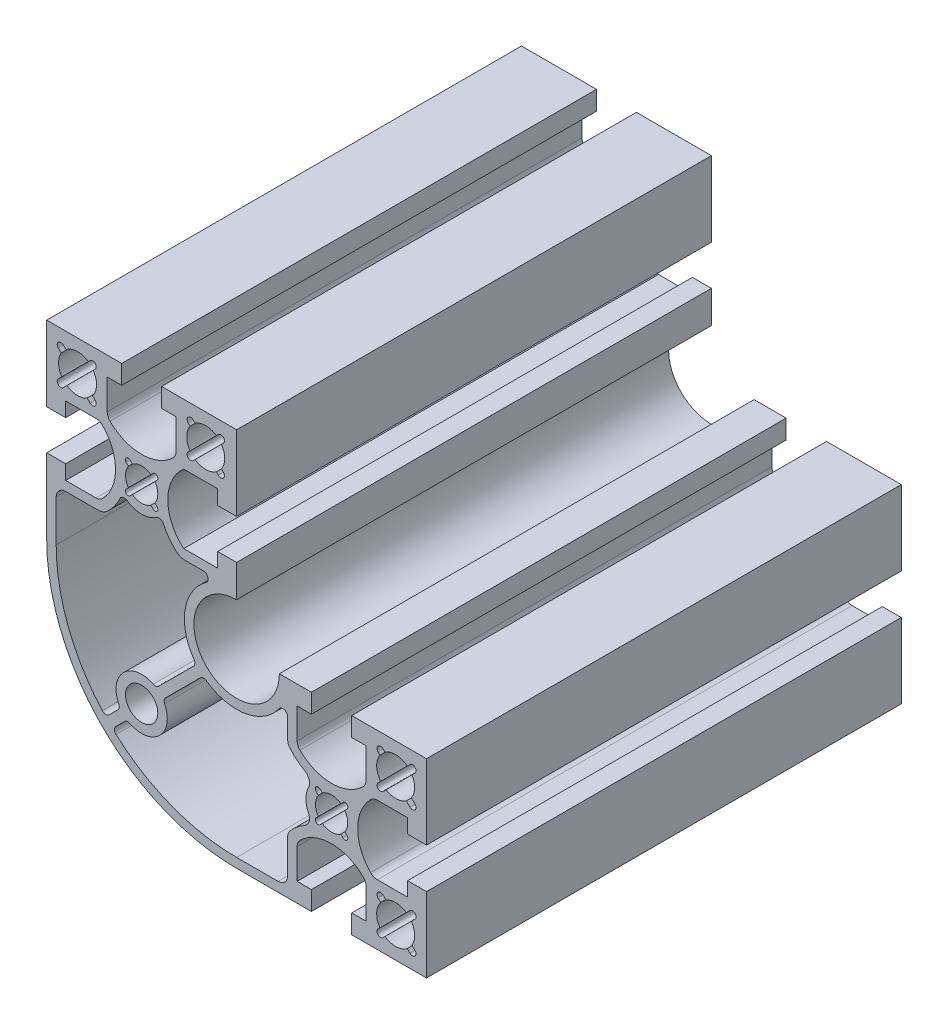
from build123d import *

# Parameters (mm, degrees)
EXTRUDE_1_DEPTH     = 50
SKETCH_2_R          = 4
SKETCH_2_R_2        = 3.4
CUT_EXTRUDE_1_DEPTH = 115.891252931
CUT_EXTRUDE_2_DEPTH = 115.891252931
CUT_EXTRUDE_3_DEPTH = 115.891252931
FILLET_1_R          = 2
CUT_EXTRUDE_5_DEPTH = 115.891252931


with BuildPart() as part:
    # Sketch 1 → Extrude 1 (new, symmetric)
    with BuildSketch(Plane.XY):
        with BuildLine():
            Line((0, 40), (0, 9))
            ThreePointArc((0, 9), (-6.363961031, -6.363961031), (9, 0))
            Line((9, 0), (40, 0))
            Line((40, 0), (40, -40))
            Line((40, -40), (0, -40))
            ThreePointArc((0, -40), (-28.284271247, -28.284271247), (-40, 0))
            Line((-40, 0), (-40, 40))
            Line((-40, 40), (0, 40))
        make_face()
    extrude(amount=EXTRUDE_1_DEPTH, both=True)

    # Sketch 2 → Cut-Extrude 1 (cut, through all)
    with BuildSketch(Plane.XY.offset(50)):
        with Locations((-33.5, 33.5)):
            Circle(SKETCH_2_R)
        with Locations((-6.5, 33.5)):
            Circle(SKETCH_2_R)
        with Locations((-20, 20)):
            Circle(SKETCH_2_R_2)
        with Locations((-20, -20)):
            Circle(SKETCH_2_R_2)
        with Locations((33.5, -33.5)):
            Circle(SKETCH_2_R)
        with Locations(Location((33.5, -6.5, 0), (0, 0, 180))):
            Circle(SKETCH_2_R)
        with Locations((20, -20)):
            Circle(SKETCH_2_R_2)
    extrude(amount=-CUT_EXTRUDE_1_DEPTH, mode=Mode.SUBTRACT)

    # Sketch 3 → Cut-Extrude 2 (cut, through all)
    with BuildSketch(Plane.XY.offset(50)):
        with BuildLine():
            Line((-29.787689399, 36.151650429), (-30.848349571, 35.090990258))
            ThreePointArc((-30.848349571, 35.090990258), (-31.909009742, 35.090990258), (-31.909009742, 36.151650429))
            Line((-31.909009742, 36.151650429), (-30.848349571, 37.212310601))
            ThreePointArc((-30.848349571, 37.212310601), (-29.787689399, 37.212310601), (-29.787689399, 36.151650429))
        make_face()
        with BuildLine():
            Line((-30.848349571, 29.434136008), (-31.909009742, 30.49479618))
            ThreePointArc((-31.909009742, 30.49479618), (-31.909009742, 31.555456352), (-30.848349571, 31.555456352))
            Line((-30.848349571, 31.555456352), (-29.787689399, 30.49479618))
            ThreePointArc((-29.787689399, 30.49479618), (-29.787689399, 29.434136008), (-30.848349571, 29.434136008))
        make_face()
        with BuildLine():
            Line((-37.565863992, 30.49479618), (-36.50520382, 31.555456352))
            ThreePointArc((-36.50520382, 31.555456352), (-35.444543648, 31.555456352), (-35.444543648, 30.49479618))
            Line((-35.444543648, 30.49479618), (-36.50520382, 29.434136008))
            ThreePointArc((-36.50520382, 29.434136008), (-37.565863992, 29.434136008), (-37.565863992, 30.49479618))
        make_face()
        with BuildLine():
            Line((-36.50520382, 37.212310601), (-35.444543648, 36.151650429))
            ThreePointArc((-35.444543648, 36.151650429), (-35.444543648, 35.090990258), (-36.50520382, 35.090990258))
            Line((-36.50520382, 35.090990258), (-37.565863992, 36.151650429))
            ThreePointArc((-37.565863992, 36.151650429), (-37.565863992, 37.212310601), (-36.50520382, 37.212310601))
        make_face()
        with BuildLine():
            Line((-2.787689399, 36.151650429), (-3.848349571, 35.090990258))
            ThreePointArc((-3.848349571, 35.090990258), (-4.909009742, 35.090990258), (-4.909009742, 36.151650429))
            Line((-4.909009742, 36.151650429), (-3.848349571, 37.212310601))
            ThreePointArc((-3.848349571, 37.212310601), (-2.787689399, 37.212310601), (-2.787689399, 36.151650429))
        make_face()
        with BuildLine():
            Line((-3.848349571, 29.787689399), (-4.909009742, 30.848349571))
            ThreePointArc((-4.909009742, 30.848349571), (-4.909009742, 31.909009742), (-3.848349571, 31.909009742))
            Line((-3.848349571, 31.909009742), (-2.787689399, 30.848349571))
            ThreePointArc((-2.787689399, 30.848349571), (-2.787689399, 29.787689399), (-3.848349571, 29.787689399))
        make_face()
        with BuildLine():
            Line((-10.212310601, 30.848349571), (-9.151650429, 31.909009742))
            ThreePointArc((-9.151650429, 31.909009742), (-8.090990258, 31.909009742), (-8.090990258, 30.848349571))
            Line((-8.090990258, 30.848349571), (-9.151650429, 29.787689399))
            ThreePointArc((-9.151650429, 29.787689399), (-10.212310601, 29.787689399), (-10.212310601, 30.848349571))
        make_face()
        with BuildLine():
            Line((-9.151650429, 37.212310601), (-8.090990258, 36.151650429))
            ThreePointArc((-8.090990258, 36.151650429), (-8.090990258, 35.090990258), (-9.151650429, 35.090990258))
            Line((-9.151650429, 35.090990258), (-10.212310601, 36.151650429))
            ThreePointArc((-10.212310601, 36.151650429), (-10.212310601, 37.212310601), (-9.151650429, 37.212310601))
        make_face()
        with BuildLine():
            Line((-16.747308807, 22.404163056), (-17.454415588, 21.697056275))
            ThreePointArc((-17.454415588, 21.697056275), (-18.302943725, 21.697056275), (-18.302943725, 22.545584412))
            Line((-18.302943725, 22.545584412), (-17.595836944, 23.252691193))
            ThreePointArc((-17.595836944, 23.252691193), (-16.747308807, 23.252691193), (-16.747308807, 22.404163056))
        make_face()
        with BuildLine():
            Line((-17.595836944, 16.747308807), (-18.302943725, 17.454415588))
            ThreePointArc((-18.302943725, 17.454415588), (-18.302943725, 18.302943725), (-17.454415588, 18.302943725))
            Line((-17.454415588, 18.302943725), (-16.747308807, 17.595836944))
            ThreePointArc((-16.747308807, 17.595836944), (-16.747308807, 16.747308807), (-17.595836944, 16.747308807))
        make_face()
        with BuildLine():
            Line((-23.252691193, 17.595836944), (-22.545584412, 18.302943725))
            ThreePointArc((-22.545584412, 18.302943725), (-21.697056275, 18.302943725), (-21.697056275, 17.454415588))
            Line((-21.697056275, 17.454415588), (-22.404163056, 16.747308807))
            ThreePointArc((-22.404163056, 16.747308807), (-23.252691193, 16.747308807), (-23.252691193, 17.595836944))
        make_face()
        with BuildLine():
            Line((-22.404163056, 23.252691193), (-21.697056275, 22.545584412))
            ThreePointArc((-21.697056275, 22.545584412), (-21.697056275, 21.697056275), (-22.545584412, 21.697056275))
            Line((-22.545584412, 21.697056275), (-23.252691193, 22.404163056))
            ThreePointArc((-23.252691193, 22.404163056), (-23.252691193, 23.252691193), (-22.404163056, 23.252691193))
        make_face()
        with BuildLine():
            Line((29.787689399, -36.151650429), (30.848349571, -35.090990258))
            ThreePointArc((30.848349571, -35.090990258), (31.909009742, -35.090990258), (31.909009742, -36.151650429))
            Line((31.909009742, -36.151650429), (30.848349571, -37.212310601))
            ThreePointArc((30.848349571, -37.212310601), (29.787689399, -37.212310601), (29.787689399, -36.151650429))
        make_face()
        with BuildLine():
            Line((30.848349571, -29.434136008), (31.909009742, -30.49479618))
            ThreePointArc((31.909009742, -30.49479618), (31.909009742, -31.555456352), (30.848349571, -31.555456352))
            Line((30.848349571, -31.555456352), (29.787689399, -30.49479618))
            ThreePointArc((29.787689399, -30.49479618), (29.787689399, -29.434136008), (30.848349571, -29.434136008))
        make_face()
        with BuildLine():
            Line((37.565863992, -30.49479618), (36.50520382, -31.555456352))
            ThreePointArc((36.50520382, -31.555456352), (35.444543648, -31.555456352), (35.444543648, -30.49479618))
            Line((35.444543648, -30.49479618), (36.50520382, -29.434136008))
            ThreePointArc((36.50520382, -29.434136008), (37.565863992, -29.434136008), (37.565863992, -30.49479618))
        make_face()
        with BuildLine():
            Line((36.50520382, -37.212310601), (35.444543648, -36.151650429))
            ThreePointArc((35.444543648, -36.151650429), (35.444543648, -35.090990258), (36.50520382, -35.090990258))
            Line((36.50520382, -35.090990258), (37.565863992, -36.151650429))
            ThreePointArc((37.565863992, -36.151650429), (37.565863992, -37.212310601), (36.50520382, -37.212310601))
        make_face()
        with BuildLine():
            Line((16.747308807, -22.404163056), (17.454415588, -21.697056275))
            ThreePointArc((17.454415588, -21.697056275), (18.302943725, -21.697056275), (18.302943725, -22.545584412))
            Line((18.302943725, -22.545584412), (17.595836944, -23.252691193))
            ThreePointArc((17.595836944, -23.252691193), (16.747308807, -23.252691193), (16.747308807, -22.404163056))
        make_face()
        with BuildLine():
            Line((17.595836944, -16.747308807), (18.302943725, -17.454415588))
            ThreePointArc((18.302943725, -17.454415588), (18.302943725, -18.302943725), (17.454415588, -18.302943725))
            Line((17.454415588, -18.302943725), (16.747308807, -17.595836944))
            ThreePointArc((16.747308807, -17.595836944), (16.747308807, -16.747308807), (17.595836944, -16.747308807))
        make_face()
        with BuildLine():
            Line((23.252691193, -17.595836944), (22.545584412, -18.302943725))
            ThreePointArc((22.545584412, -18.302943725), (21.697056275, -18.302943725), (21.697056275, -17.454415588))
            Line((21.697056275, -17.454415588), (22.404163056, -16.747308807))
            ThreePointArc((22.404163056, -16.747308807), (23.252691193, -16.747308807), (23.252691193, -17.595836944))
        make_face()
        with BuildLine():
            Line((22.404163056, -23.252691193), (21.697056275, -22.545584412))
            ThreePointArc((21.697056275, -22.545584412), (21.697056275, -21.697056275), (22.545584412, -21.697056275))
            Line((22.545584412, -21.697056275), (23.252691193, -22.404163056))
            ThreePointArc((23.252691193, -22.404163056), (23.252691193, -23.252691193), (22.404163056, -23.252691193))
        make_face()
        with BuildLine():
            Line((36.50520382, -2.787689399), (35.444543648, -3.848349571))
            ThreePointArc((35.444543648, -3.848349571), (35.444543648, -4.909009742), (36.50520382, -4.909009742))
            Line((36.50520382, -4.909009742), (37.565863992, -3.848349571))
            ThreePointArc((37.565863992, -3.848349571), (37.565863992, -2.787689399), (36.50520382, -2.787689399))
        make_face()
        with BuildLine():
            Line((37.565863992, -9.50520382), (36.50520382, -8.444543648))
            ThreePointArc((36.50520382, -8.444543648), (35.444543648, -8.444543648), (35.444543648, -9.50520382))
            Line((35.444543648, -9.50520382), (36.50520382, -10.565863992))
            ThreePointArc((36.50520382, -10.565863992), (37.565863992, -10.565863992), (37.565863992, -9.50520382))
        make_face()
        with BuildLine():
            Line((30.848349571, -10.565863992), (31.909009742, -9.50520382))
            ThreePointArc((31.909009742, -9.50520382), (31.909009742, -8.444543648), (30.848349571, -8.444543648))
            Line((30.848349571, -8.444543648), (29.787689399, -9.50520382))
            ThreePointArc((29.787689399, -9.50520382), (29.787689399, -10.565863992), (30.848349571, -10.565863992))
        make_face()
        with BuildLine():
            Line((29.787689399, -3.848349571), (30.848349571, -4.909009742))
            ThreePointArc((30.848349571, -4.909009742), (31.909009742, -4.909009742), (31.909009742, -3.848349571))
            Line((31.909009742, -3.848349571), (30.848349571, -2.787689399))
            ThreePointArc((30.848349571, -2.787689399), (29.787689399, -2.787689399), (29.787689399, -3.848349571))
        make_face()
    extrude(amount=-CUT_EXTRUDE_2_DEPTH, mode=Mode.SUBTRACT)

    # Sketch 4 → Cut-Extrude 3 (cut, through all)
    with BuildSketch(Plane.XY.offset(50)):
        with BuildLine():
            Line((-24.2, 40), (-24.2, 36))
            Line((-24.2, 36), (-27.25, 36))
            Line((-27.25, 36), (-27.25, 28.860985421))
            ThreePointArc((-27.25, 28.860985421), (-20, 25.5), (-12.75, 28.860985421))
            Line((-12.75, 28.860985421), (-12.75, 36))
            Line((-12.75, 36), (-15.8, 36))
            Line((-15.8, 36), (-15.8, 40))
            Line((-15.8, 40), (-24.2, 40))
        make_face()
        with BuildLine():
            Line((0, 24.2), (0, 15.8))
            Line((0, 15.8), (-4, 15.8))
            Line((-4, 15.8), (-4, 12.75))
            Line((-4, 12.75), (-11.139014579, 12.75))
            ThreePointArc((-11.139014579, 12.75), (-14.5, 20), (-11.139014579, 27.25))
            Line((-11.139014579, 27.25), (-4, 27.25))
            Line((-4, 27.25), (-4, 24.2))
            Line((-4, 24.2), (0, 24.2))
        make_face()
        with BuildLine():
            Line((-40, 15.8), (-40, 24.2))
            Line((-40, 24.2), (-36, 24.2))
            Line((-36, 24.2), (-36, 27.25))
            Line((-36, 27.25), (-28.860985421, 27.25))
            ThreePointArc((-28.860985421, 27.25), (-25.5, 20), (-28.860985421, 12.75))
            Line((-28.860985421, 12.75), (-36, 12.75))
            Line((-36, 12.75), (-36, 15.8))
            Line((-36, 15.8), (-40, 15.8))
        make_face()
        with BuildLine():
            Line((12.75, -4), (12.75, -11.139014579))
            ThreePointArc((12.75, -11.139014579), (20, -14.5), (27.25, -11.139014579))
            Line((27.25, -11.139014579), (27.25, -4))
            Line((27.25, -4), (24.25, -4))
            Line((24.25, -4), (24.25, 0))
            Line((24.25, 0), (15.75, 0))
            Line((15.75, 0), (15.75, -4))
            Line((15.75, -4), (12.75, -4))
        make_face()
        with BuildLine():
            Line((24.25, -40), (24.25, -36))
            Line((24.25, -36), (27.25, -36))
            Line((27.25, -36), (27.25, -28.860985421))
            ThreePointArc((27.25, -28.860985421), (20, -25.5), (12.75, -28.860985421))
            Line((12.75, -28.860985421), (12.75, -36))
            Line((12.75, -36), (15.75, -36))
            Line((15.75, -36), (15.75, -40))
            Line((15.75, -40), (24.25, -40))
        make_face()
        with BuildLine():
            Line((40, -15.75), (40, -24.25))
            Line((40, -24.25), (36, -24.25))
            Line((36, -24.25), (36, -27.25))
            Line((36, -27.25), (28.860985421, -27.25))
            ThreePointArc((28.860985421, -27.25), (25.5, -20), (28.860985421, -12.75))
            Line((28.860985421, -12.75), (36, -12.75))
            Line((36, -12.75), (36, -15.75))
            Line((36, -15.75), (40, -15.75))
        make_face()
    extrude(amount=-CUT_EXTRUDE_3_DEPTH, mode=Mode.SUBTRACT)

    # Fillet 1
    fillet_1_edges = [part.edges().sort_by_distance(p)[0] for p in [
        (-12.75, 28.860985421, 0),
        (-27.25, 28.860985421, 0),
        (28.860985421, -27.25, 0),
        (28.860985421, -12.75, 0),
        (-28.860985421, 27.25, 0),
        (-28.860985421, 12.75, 0),
        (27.25, -11.139014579, 0),
        (12.75, -11.139014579, 0),
        (12.75, -28.860985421, 0),
        (27.25, -28.860985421, 0),
    ]]
    fillet(fillet_1_edges, radius=FILLET_1_R)

    # Sketch 5 → Cut-Extrude 5 (cut, through all)
    with BuildSketch(Plane.XY.offset(50)):
        with BuildLine():
            Line((-9.073707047, -7.659493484), (-16.408269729, -14.994056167))
            ThreePointArc((-16.408269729, -14.994056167), (-16.957132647, -15.274349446), (-17.566098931, -15.179613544))
            ThreePointArc((-17.566098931, -15.179613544), (-23.818376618, -16.181623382), (-24.820386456, -22.433901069))
            ThreePointArc((-24.820386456, -22.433901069), (-24.725650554, -23.042867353), (-25.005943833, -23.591730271))
            Line((-25.005943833, -23.591730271), (-26.831807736, -25.417594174))
            ThreePointArc((-26.831807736, -25.417594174), (-27.565951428, -25.710121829), (-28.283209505, -25.378338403))
            ThreePointArc((-28.283209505, -25.378338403), (-35.487758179, -13.587458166), (-38, 0))
            Line((-38, 0), (-38, 8.75))
            ThreePointArc((-38, 8.75), (-37.414213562, 10.164213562), (-36, 10.75))
            Line((-36, 10.75), (-29.239140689, 10.75))
            ThreePointArc((-29.239140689, 10.75), (-28.147730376, 10.955572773), (-27.205896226, 11.544117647))
            ThreePointArc((-27.205896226, 11.544117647), (-25.706823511, 13.22601515), (-24.56444, 15.16791065))
            ThreePointArc((-24.56444, 15.16791065), (-23.918394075, 15.712961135), (-23.08559375, 15.568396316))
            ThreePointArc((-23.08559375, 15.568396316), (-20, 14.6), (-16.91440625, 15.568396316))
            ThreePointArc((-16.91440625, 15.568396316), (-16.081605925, 15.712961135), (-15.43556, 15.16791065))
            ThreePointArc((-15.43556, 15.16791065), (-14.293176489, 13.22601515), (-12.794103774, 11.544117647))
            ThreePointArc((-12.794103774, 11.544117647), (-11.852269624, 10.955572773), (-10.760859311, 10.75))
            Line((-10.760859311, 10.75), (-6.99553429, 10.75))
            ThreePointArc((-6.99553429, 10.75), (-6.043562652, 10.056186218), (-6.412573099, 8.9375))
            ThreePointArc((-6.412573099, 8.9375), (-10.850170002, 1.809367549), (-8.965746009, -6.373021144))
            ThreePointArc((-8.965746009, -6.373021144), (-8.784316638, -7.036012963), (-9.073707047, -7.659493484))
        make_face()
        with BuildLine():
            Line((-7.659493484, -9.073707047), (-14.994056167, -16.408269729))
            ThreePointArc((-14.994056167, -16.408269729), (-15.274349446, -16.957132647), (-15.179613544, -17.566098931))
            ThreePointArc((-15.179613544, -17.566098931), (-16.181623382, -23.818376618), (-22.433901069, -24.820386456))
            ThreePointArc((-22.433901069, -24.820386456), (-23.042867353, -24.725650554), (-23.591730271, -25.005943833))
            Line((-23.591730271, -25.005943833), (-25.417594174, -26.831807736))
            ThreePointArc((-25.417594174, -26.831807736), (-25.710121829, -27.565951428), (-25.378338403, -28.283209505))
            ThreePointArc((-25.378338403, -28.283209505), (-13.587458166, -35.487758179), (0, -38))
            Line((0, -38), (8.75, -38))
            ThreePointArc((8.75, -38), (10.164213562, -37.414213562), (10.75, -36))
            Line((10.75, -36), (10.75, -28.860985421))
            ThreePointArc((10.75, -28.860985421), (10.872151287, -28.172738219), (11.223684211, -27.568561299))
            ThreePointArc((11.223684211, -27.568561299), (12.666179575, -26.14194841), (14.336925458, -24.991024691))
            ThreePointArc((14.336925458, -24.991024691), (15.262373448, -23.842479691), (15.148788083, -22.371864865))
            ThreePointArc((15.148788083, -22.371864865), (14.6, -20), (15.148788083, -17.628135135))
            ThreePointArc((15.148788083, -17.628135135), (15.262373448, -16.157520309), (14.336925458, -15.008975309))
            ThreePointArc((14.336925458, -15.008975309), (12.666179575, -13.85805159), (11.223684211, -12.431438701))
            ThreePointArc((11.223684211, -12.431438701), (10.872151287, -11.827261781), (10.75, -11.139014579))
            Line((10.75, -11.139014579), (10.75, -6.99553429))
            ThreePointArc((10.75, -6.99553429), (10.056186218, -6.043562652), (8.9375, -6.412573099))
            ThreePointArc((8.9375, -6.412573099), (1.809367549, -10.850170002), (-6.373021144, -8.965746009))
            ThreePointArc((-6.373021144, -8.965746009), (-7.036012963, -8.784316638), (-7.659493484, -9.073707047))
        make_face()
    extrude(amount=-CUT_EXTRUDE_5_DEPTH, mode=Mode.SUBTRACT)


solid = part.part
